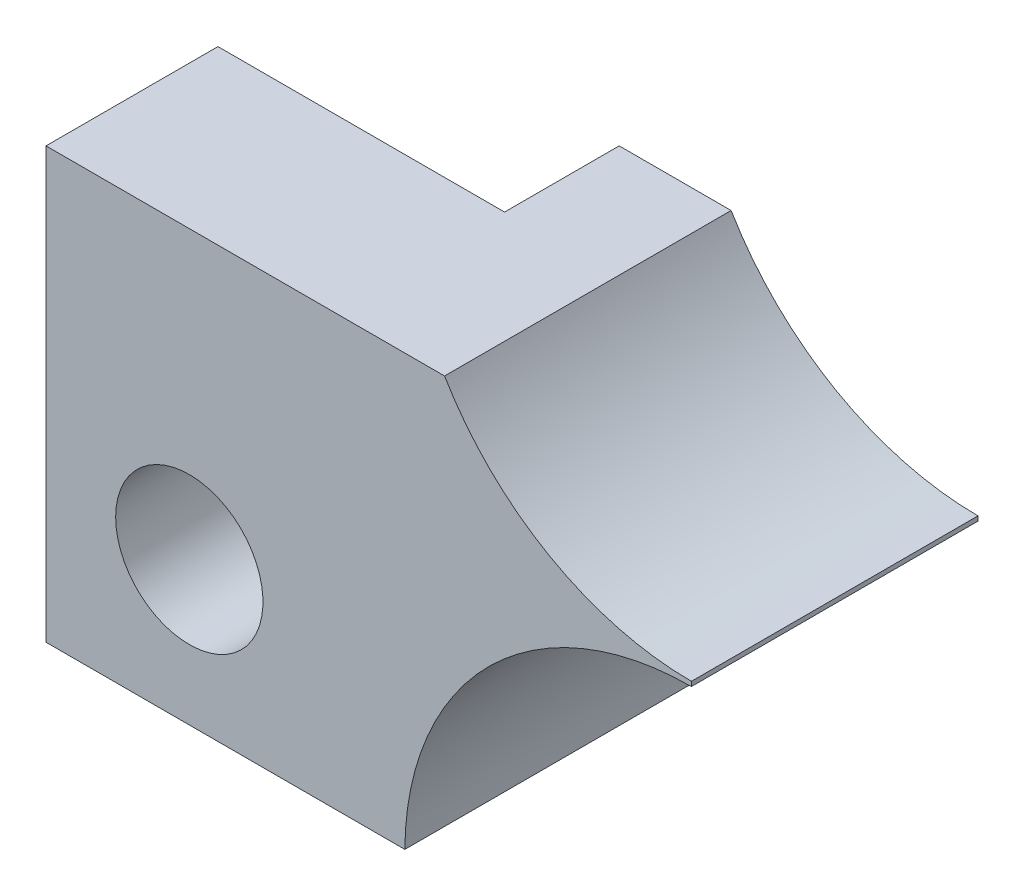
ISO-10303-21;
HEADER;
FILE_DESCRIPTION(('STEP AP214'),'2;1');
FILE_NAME('part.step','',(''),(''),'','','');
FILE_SCHEMA(('AUTOMOTIVE_DESIGN { 1 0 10303 214 1 1 1 1 }'));
ENDSEC;
DATA;
#1=APPLICATION_CONTEXT('core data for automotive mechanical design processes');
#2=APPLICATION_PROTOCOL_DEFINITION('international standard','automotive_design',2000,#1);
#3=PRODUCT_CONTEXT('',#1,'mechanical');
#4=PRODUCT('Part','Part','',(#3));
#5=PRODUCT_RELATED_PRODUCT_CATEGORY('part','',(#4));
#6=PRODUCT_DEFINITION_FORMATION('','',#4);
#7=PRODUCT_DEFINITION_CONTEXT('part definition',#1,'design');
#8=PRODUCT_DEFINITION('design','',#6,#7);
#9=PRODUCT_DEFINITION_SHAPE('','',#8);
#10=(LENGTH_UNIT() NAMED_UNIT(*) SI_UNIT(.MILLI.,.METRE.));
#11=(NAMED_UNIT(*) PLANE_ANGLE_UNIT() SI_UNIT($,.RADIAN.));
#12=(NAMED_UNIT(*) SI_UNIT($,.STERADIAN.) SOLID_ANGLE_UNIT());
#13=UNCERTAINTY_MEASURE_WITH_UNIT(LENGTH_MEASURE(1.E-05),#10,'distance_accuracy_value','');
#14=(GEOMETRIC_REPRESENTATION_CONTEXT(3) GLOBAL_UNCERTAINTY_ASSIGNED_CONTEXT((#13)) GLOBAL_UNIT_ASSIGNED_CONTEXT((#10,
#11,#12)) REPRESENTATION_CONTEXT('',''));
#15=CARTESIAN_POINT('',(0.,0.,0.));
#16=DIRECTION('',(0.,0.,1.));
#17=DIRECTION('',(1.,0.,0.));
#18=AXIS2_PLACEMENT_3D('',#15,#16,#17);
#19=CARTESIAN_POINT('',(-32.4430669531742,6.35000000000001,0.));
#20=DIRECTION('',(0.,0.,-1.));
#21=DIRECTION('',(-1.,0.,0.));
#22=AXIS2_PLACEMENT_3D('',#19,#20,#21);
#23=PLANE('',#22);
#24=CARTESIAN_POINT('',(14.3002,12.7508,0.));
#25=DIRECTION('',(0.,0.,-1.));
#26=DIRECTION('',(-1.,0.,0.));
#27=AXIS2_PLACEMENT_3D('',#24,#25,#26);
#28=CIRCLE('',#27,6.35);
#29=CARTESIAN_POINT('',(14.3002,6.4008,0.));
#30=VERTEX_POINT('',#29);
#31=CARTESIAN_POINT('',(8.83058261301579,9.52499999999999,0.));
#32=VERTEX_POINT('',#31);
#33=EDGE_CURVE('E139',#30,#32,#28,.T.);
#34=ORIENTED_EDGE('',*,*,#33,.F.);
#35=DIRECTION('',(0.,-1.,0.));
#36=VECTOR('',#35,1.);
#37=CARTESIAN_POINT('',(14.3002,6.35,0.));
#38=LINE('',#37,#36);
#39=CARTESIAN_POINT('',(14.3002,6.2992,0.));
#40=VERTEX_POINT('',#39);
#41=EDGE_CURVE('E114',#30,#40,#38,.T.);
#42=ORIENTED_EDGE('',*,*,#41,.T.);
#43=CARTESIAN_POINT('',(14.3002,-0.0508000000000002,0.));
#44=DIRECTION('',(0.,0.,-1.));
#45=DIRECTION('',(-1.,0.,0.));
#46=AXIS2_PLACEMENT_3D('',#43,#44,#45);
#47=CIRCLE('',#46,6.35);
#48=CARTESIAN_POINT('',(7.9504032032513,0.,0.));
#49=VERTEX_POINT('',#48);
#50=EDGE_CURVE('E112',#49,#40,#47,.T.);
#51=ORIENTED_EDGE('',*,*,#50,.F.);
#52=DIRECTION('',(-1.,0.,0.));
#53=VECTOR('',#52,1.);
#54=CARTESIAN_POINT('',(-32.4430669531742,0.,0.));
#55=LINE('',#54,#53);
#56=CARTESIAN_POINT('',(6.35,0.,0.));
#57=VERTEX_POINT('',#56);
#58=EDGE_CURVE('E134',#49,#57,#55,.T.);
#59=ORIENTED_EDGE('',*,*,#58,.T.);
#60=DIRECTION('',(0.,-1.,0.));
#61=VECTOR('',#60,1.);
#62=CARTESIAN_POINT('',(6.35,6.35000000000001,0.));
#63=LINE('',#62,#61);
#64=CARTESIAN_POINT('',(6.35,9.525,0.));
#65=VERTEX_POINT('',#64);
#66=EDGE_CURVE('E11',#65,#57,#63,.T.);
#67=ORIENTED_EDGE('',*,*,#66,.F.);
#68=DIRECTION('',(-1.,0.,0.));
#69=VECTOR('',#68,1.);
#70=CARTESIAN_POINT('',(-32.4430669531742,9.525,0.));
#71=LINE('',#70,#69);
#72=EDGE_CURVE('E123',#32,#65,#71,.T.);
#73=ORIENTED_EDGE('',*,*,#72,.F.);
#74=EDGE_LOOP('',(#34,#42,#51,#59,#67,#73));
#75=FACE_BOUND('',#74,.T.);
#76=ADVANCED_FACE('F33',(#75),#23,.T.);
#77=CARTESIAN_POINT('',(14.3002,-0.0508000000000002,6.35));
#78=DIRECTION('',(0.,0.,-1.));
#79=DIRECTION('',(-1.,0.,0.));
#80=AXIS2_PLACEMENT_3D('',#77,#78,#79);
#81=CYLINDRICAL_SURFACE('',#80,6.35);
#82=DIRECTION('',(0.,0.,-1.));
#83=VECTOR('',#82,1.);
#84=CARTESIAN_POINT('',(14.3002,6.2992,6.35));
#85=LINE('',#84,#83);
#86=CARTESIAN_POINT('',(14.3002,6.2992,6.35));
#87=VERTEX_POINT('',#86);
#88=EDGE_CURVE('E99',#87,#40,#85,.T.);
#89=ORIENTED_EDGE('',*,*,#88,.F.);
#90=CARTESIAN_POINT('',(14.3002,-0.0508000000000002,6.35));
#91=DIRECTION('',(0.,0.,-1.));
#92=DIRECTION('',(-1.,0.,0.));
#93=AXIS2_PLACEMENT_3D('',#90,#91,#92);
#94=CIRCLE('',#93,6.35);
#95=CARTESIAN_POINT('',(7.9504032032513,0.,6.35));
#96=VERTEX_POINT('',#95);
#97=EDGE_CURVE('E109',#96,#87,#94,.T.);
#98=ORIENTED_EDGE('',*,*,#97,.F.);
#99=DIRECTION('',(0.,0.,-1.));
#100=VECTOR('',#99,1.);
#101=CARTESIAN_POINT('',(7.9504032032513,0.,6.35));
#102=LINE('',#101,#100);
#103=EDGE_CURVE('E42',#96,#49,#102,.T.);
#104=ORIENTED_EDGE('',*,*,#103,.T.);
#105=ORIENTED_EDGE('',*,*,#50,.T.);
#106=EDGE_LOOP('',(#89,#98,#104,#105));
#107=FACE_BOUND('',#106,.T.);
#108=ADVANCED_FACE('F108',(#107),#81,.F.);
#109=CARTESIAN_POINT('',(14.3002,12.7508,6.35));
#110=DIRECTION('',(0.,0.,-1.));
#111=DIRECTION('',(-1.,0.,0.));
#112=AXIS2_PLACEMENT_3D('',#109,#110,#111);
#113=CYLINDRICAL_SURFACE('',#112,6.35);
#114=DIRECTION('',(0.,0.,-1.));
#115=VECTOR('',#114,1.);
#116=CARTESIAN_POINT('',(14.3002,6.4008,6.35));
#117=LINE('',#116,#115);
#118=CARTESIAN_POINT('',(14.3002,6.4008,6.35));
#119=VERTEX_POINT('',#118);
#120=EDGE_CURVE('E49',#30,#119,#117,.F.);
#121=ORIENTED_EDGE('',*,*,#120,.F.);
#122=ORIENTED_EDGE('',*,*,#33,.T.);
#123=DIRECTION('',(0.,0.,-1.));
#124=VECTOR('',#123,1.);
#125=CARTESIAN_POINT('',(8.83058261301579,9.52499999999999,6.35));
#126=LINE('',#125,#124);
#127=CARTESIAN_POINT('',(8.83058261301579,9.52499999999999,6.35));
#128=VERTEX_POINT('',#127);
#129=EDGE_CURVE('E148',#128,#32,#126,.T.);
#130=ORIENTED_EDGE('',*,*,#129,.F.);
#131=CARTESIAN_POINT('',(14.3002,12.7508,6.35));
#132=DIRECTION('',(0.,0.,-1.));
#133=DIRECTION('',(-1.,0.,0.));
#134=AXIS2_PLACEMENT_3D('',#131,#132,#133);
#135=CIRCLE('',#134,6.35);
#136=EDGE_CURVE('E119',#119,#128,#135,.T.);
#137=ORIENTED_EDGE('',*,*,#136,.F.);
#138=EDGE_LOOP('',(#121,#122,#130,#137));
#139=FACE_BOUND('',#138,.T.);
#140=ADVANCED_FACE('F187',(#139),#113,.F.);
#141=CARTESIAN_POINT('',(-32.4430669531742,6.35000000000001,6.35));
#142=DIRECTION('',(0.,0.,-1.));
#143=DIRECTION('',(-1.,0.,0.));
#144=AXIS2_PLACEMENT_3D('',#141,#142,#143);
#145=PLANE('',#144);
#146=CARTESIAN_POINT('',(3.175,3.175,6.35));
#147=DIRECTION('',(0.,0.,-1.));
#148=DIRECTION('',(-1.,0.,0.));
#149=AXIS2_PLACEMENT_3D('',#146,#147,#148);
#150=CIRCLE('',#149,1.63195);
#151=CARTESIAN_POINT('',(1.54305,3.175,6.35));
#152=VERTEX_POINT('',#151);
#153=EDGE_CURVE('E130',#152,#152,#150,.T.);
#154=ORIENTED_EDGE('',*,*,#153,.T.);
#155=EDGE_LOOP('',(#154));
#156=FACE_BOUND('',#155,.T.);
#157=DIRECTION('',(0.,1.,0.));
#158=VECTOR('',#157,1.);
#159=CARTESIAN_POINT('',(14.3002,25.3492,6.35));
#160=LINE('',#159,#158);
#161=EDGE_CURVE('E96',#87,#119,#160,.T.);
#162=ORIENTED_EDGE('',*,*,#161,.T.);
#163=ORIENTED_EDGE('',*,*,#136,.T.);
#164=DIRECTION('',(-1.,0.,0.));
#165=VECTOR('',#164,1.);
#166=CARTESIAN_POINT('',(-32.4430669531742,9.525,6.35));
#167=LINE('',#166,#165);
#168=CARTESIAN_POINT('',(0.,9.525,6.35));
#169=VERTEX_POINT('',#168);
#170=EDGE_CURVE('E121',#128,#169,#167,.T.);
#171=ORIENTED_EDGE('',*,*,#170,.T.);
#172=DIRECTION('',(0.,-1.,0.));
#173=VECTOR('',#172,1.);
#174=CARTESIAN_POINT('',(0.,6.35000000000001,6.35));
#175=LINE('',#174,#173);
#176=CARTESIAN_POINT('',(0.,0.,6.35));
#177=VERTEX_POINT('',#176);
#178=EDGE_CURVE('E128',#169,#177,#175,.T.);
#179=ORIENTED_EDGE('',*,*,#178,.T.);
#180=DIRECTION('',(-1.,0.,0.));
#181=VECTOR('',#180,1.);
#182=CARTESIAN_POINT('',(-32.4430669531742,0.,6.35));
#183=LINE('',#182,#181);
#184=EDGE_CURVE('E118',#96,#177,#183,.T.);
#185=ORIENTED_EDGE('',*,*,#184,.F.);
#186=ORIENTED_EDGE('',*,*,#97,.T.);
#187=EDGE_LOOP('',(#162,#163,#171,#179,#185,#186));
#188=FACE_BOUND('',#187,.T.);
#189=ADVANCED_FACE('F116',(#156,#188),#145,.F.);
#190=CARTESIAN_POINT('',(-32.4430669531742,0.,6.35));
#191=DIRECTION('',(0.,-1.,0.));
#192=DIRECTION('',(0.,0.,-1.));
#193=AXIS2_PLACEMENT_3D('',#190,#191,#192);
#194=PLANE('',#193);
#195=DIRECTION('',(-1.,0.,0.));
#196=VECTOR('',#195,1.);
#197=CARTESIAN_POINT('',(0.,0.,2.54));
#198=LINE('',#197,#196);
#199=CARTESIAN_POINT('',(6.35,0.,2.54));
#200=VERTEX_POINT('',#199);
#201=CARTESIAN_POINT('',(0.,0.,2.54));
#202=VERTEX_POINT('',#201);
#203=EDGE_CURVE('E158',#200,#202,#198,.T.);
#204=ORIENTED_EDGE('',*,*,#203,.F.);
#205=DIRECTION('',(0.,0.,1.));
#206=VECTOR('',#205,1.);
#207=CARTESIAN_POINT('',(6.35,0.,0.));
#208=LINE('',#207,#206);
#209=EDGE_CURVE('E113',#57,#200,#208,.T.);
#210=ORIENTED_EDGE('',*,*,#209,.F.);
#211=ORIENTED_EDGE('',*,*,#58,.F.);
#212=ORIENTED_EDGE('',*,*,#103,.F.);
#213=ORIENTED_EDGE('',*,*,#184,.T.);
#214=DIRECTION('',(0.,0.,-1.));
#215=VECTOR('',#214,1.);
#216=CARTESIAN_POINT('',(0.,0.,6.35));
#217=LINE('',#216,#215);
#218=EDGE_CURVE('E133',#177,#202,#217,.T.);
#219=ORIENTED_EDGE('',*,*,#218,.T.);
#220=EDGE_LOOP('',(#204,#210,#211,#212,#213,#219));
#221=FACE_BOUND('',#220,.T.);
#222=ADVANCED_FACE('F35',(#221),#194,.T.);
#223=CARTESIAN_POINT('',(-32.4430669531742,9.525,6.35));
#224=DIRECTION('',(0.,-1.,0.));
#225=DIRECTION('',(0.,0.,-1.));
#226=AXIS2_PLACEMENT_3D('',#223,#224,#225);
#227=PLANE('',#226);
#228=DIRECTION('',(0.,0.,1.));
#229=VECTOR('',#228,1.);
#230=CARTESIAN_POINT('',(6.35,9.525,6.35));
#231=LINE('',#230,#229);
#232=CARTESIAN_POINT('',(6.35,9.525,2.54));
#233=VERTEX_POINT('',#232);
#234=EDGE_CURVE('E56',#65,#233,#231,.T.);
#235=ORIENTED_EDGE('',*,*,#234,.T.);
#236=DIRECTION('',(-1.,0.,0.));
#237=VECTOR('',#236,1.);
#238=CARTESIAN_POINT('',(-32.4430669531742,9.525,2.54));
#239=LINE('',#238,#237);
#240=CARTESIAN_POINT('',(0.,9.525,2.54));
#241=VERTEX_POINT('',#240);
#242=EDGE_CURVE('E137',#233,#241,#239,.T.);
#243=ORIENTED_EDGE('',*,*,#242,.T.);
#244=DIRECTION('',(0.,0.,-1.));
#245=VECTOR('',#244,1.);
#246=CARTESIAN_POINT('',(0.,9.525,6.35));
#247=LINE('',#246,#245);
#248=EDGE_CURVE('E145',#169,#241,#247,.T.);
#249=ORIENTED_EDGE('',*,*,#248,.F.);
#250=ORIENTED_EDGE('',*,*,#170,.F.);
#251=ORIENTED_EDGE('',*,*,#129,.T.);
#252=ORIENTED_EDGE('',*,*,#72,.T.);
#253=EDGE_LOOP('',(#235,#243,#249,#250,#251,#252));
#254=FACE_BOUND('',#253,.T.);
#255=ADVANCED_FACE('F182',(#254),#227,.F.);
#256=CARTESIAN_POINT('',(0.,6.35000000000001,6.35));
#257=DIRECTION('',(1.,0.,0.));
#258=DIRECTION('',(0.,0.,-1.));
#259=AXIS2_PLACEMENT_3D('',#256,#257,#258);
#260=PLANE('',#259);
#261=ORIENTED_EDGE('',*,*,#248,.T.);
#262=DIRECTION('',(0.,-1.,0.));
#263=VECTOR('',#262,1.);
#264=CARTESIAN_POINT('',(0.,12.7,2.54));
#265=LINE('',#264,#263);
#266=EDGE_CURVE('E164',#241,#202,#265,.T.);
#267=ORIENTED_EDGE('',*,*,#266,.T.);
#268=ORIENTED_EDGE('',*,*,#218,.F.);
#269=ORIENTED_EDGE('',*,*,#178,.F.);
#270=EDGE_LOOP('',(#261,#267,#268,#269));
#271=FACE_BOUND('',#270,.T.);
#272=ADVANCED_FACE('F192',(#271),#260,.F.);
#273=CARTESIAN_POINT('',(3.175,3.175,6.35));
#274=DIRECTION('',(0.,0.,-1.));
#275=DIRECTION('',(-1.,0.,0.));
#276=AXIS2_PLACEMENT_3D('',#273,#274,#275);
#277=CYLINDRICAL_SURFACE('',#276,1.63195);
#278=CARTESIAN_POINT('',(3.175,3.175,2.54));
#279=DIRECTION('',(0.,0.,1.));
#280=DIRECTION('',(1.,0.,0.));
#281=AXIS2_PLACEMENT_3D('',#278,#279,#280);
#282=CIRCLE('',#281,1.63195);
#283=CARTESIAN_POINT('',(4.80695,3.175,2.54));
#284=VERTEX_POINT('',#283);
#285=EDGE_CURVE('E37',#284,#284,#282,.F.);
#286=ORIENTED_EDGE('',*,*,#285,.T.);
#287=EDGE_LOOP('',(#286));
#288=FACE_BOUND('',#287,.T.);
#289=ORIENTED_EDGE('',*,*,#153,.F.);
#290=EDGE_LOOP('',(#289));
#291=FACE_BOUND('',#290,.T.);
#292=ADVANCED_FACE('F174',(#288,#291),#277,.F.);
#293=CARTESIAN_POINT('',(0.,12.7,2.54));
#294=DIRECTION('',(0.,0.,1.));
#295=DIRECTION('',(1.,0.,0.));
#296=AXIS2_PLACEMENT_3D('',#293,#294,#295);
#297=PLANE('',#296);
#298=ORIENTED_EDGE('',*,*,#285,.F.);
#299=EDGE_LOOP('',(#298));
#300=FACE_BOUND('',#299,.T.);
#301=DIRECTION('',(0.,-1.,0.));
#302=VECTOR('',#301,1.);
#303=CARTESIAN_POINT('',(6.35,12.7,2.54));
#304=LINE('',#303,#302);
#305=EDGE_CURVE('E160',#233,#200,#304,.T.);
#306=ORIENTED_EDGE('',*,*,#305,.T.);
#307=ORIENTED_EDGE('',*,*,#203,.T.);
#308=ORIENTED_EDGE('',*,*,#266,.F.);
#309=ORIENTED_EDGE('',*,*,#242,.F.);
#310=EDGE_LOOP('',(#306,#307,#308,#309));
#311=FACE_BOUND('',#310,.T.);
#312=ADVANCED_FACE('F177',(#300,#311),#297,.F.);
#313=CARTESIAN_POINT('',(6.35,12.7,0.));
#314=DIRECTION('',(1.,0.,0.));
#315=DIRECTION('',(0.,0.,-1.));
#316=AXIS2_PLACEMENT_3D('',#313,#314,#315);
#317=PLANE('',#316);
#318=ORIENTED_EDGE('',*,*,#66,.T.);
#319=ORIENTED_EDGE('',*,*,#209,.T.);
#320=ORIENTED_EDGE('',*,*,#305,.F.);
#321=ORIENTED_EDGE('',*,*,#234,.F.);
#322=EDGE_LOOP('',(#318,#319,#320,#321));
#323=FACE_BOUND('',#322,.T.);
#324=ADVANCED_FACE('F180',(#323),#317,.F.);
#325=CARTESIAN_POINT('',(14.3002,25.3492,-2.54));
#326=DIRECTION('',(1.,0.,0.));
#327=DIRECTION('',(0.,1.,0.));
#328=AXIS2_PLACEMENT_3D('',#325,#326,#327);
#329=PLANE('',#328);
#330=ORIENTED_EDGE('',*,*,#88,.T.);
#331=ORIENTED_EDGE('',*,*,#41,.F.);
#332=ORIENTED_EDGE('',*,*,#120,.T.);
#333=ORIENTED_EDGE('',*,*,#161,.F.);
#334=EDGE_LOOP('',(#330,#331,#332,#333));
#335=FACE_BOUND('',#334,.T.);
#336=ADVANCED_FACE('F98',(#335),#329,.T.);
#337=CLOSED_SHELL('',(#76,#108,#140,#189,#222,#255,#272,#292,#312,#324,#336));
#338=MANIFOLD_SOLID_BREP('B2',#337);
#339=ADVANCED_BREP_SHAPE_REPRESENTATION('',(#18,#338),#14);
#340=SHAPE_DEFINITION_REPRESENTATION(#9,#339);
ENDSEC;
END-ISO-10303-21;
